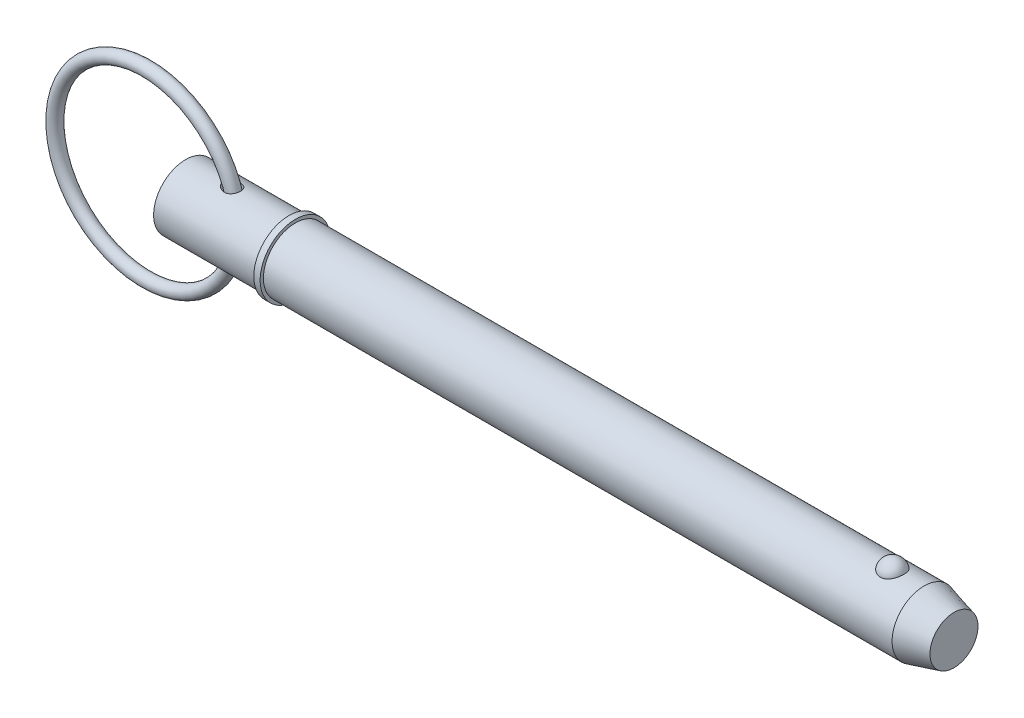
ISO-10303-21;
HEADER;
FILE_DESCRIPTION(('STEP AP214'),'2;1');
FILE_NAME('part.step','',(''),(''),'','','');
FILE_SCHEMA(('AUTOMOTIVE_DESIGN { 1 0 10303 214 1 1 1 1 }'));
ENDSEC;
DATA;
#1=APPLICATION_CONTEXT('core data for automotive mechanical design processes');
#2=APPLICATION_PROTOCOL_DEFINITION('international standard','automotive_design',2000,#1);
#3=PRODUCT_CONTEXT('',#1,'mechanical');
#4=PRODUCT('Part','Part','',(#3));
#5=PRODUCT_RELATED_PRODUCT_CATEGORY('part','',(#4));
#6=PRODUCT_DEFINITION_FORMATION('','',#4);
#7=PRODUCT_DEFINITION_CONTEXT('part definition',#1,'design');
#8=PRODUCT_DEFINITION('design','',#6,#7);
#9=PRODUCT_DEFINITION_SHAPE('','',#8);
#10=(LENGTH_UNIT() NAMED_UNIT(*) SI_UNIT(.MILLI.,.METRE.));
#11=(NAMED_UNIT(*) PLANE_ANGLE_UNIT() SI_UNIT($,.RADIAN.));
#12=(NAMED_UNIT(*) SI_UNIT($,.STERADIAN.) SOLID_ANGLE_UNIT());
#13=UNCERTAINTY_MEASURE_WITH_UNIT(LENGTH_MEASURE(1.E-05),#10,'distance_accuracy_value','');
#14=(GEOMETRIC_REPRESENTATION_CONTEXT(3) GLOBAL_UNCERTAINTY_ASSIGNED_CONTEXT((#13)) GLOBAL_UNIT_ASSIGNED_CONTEXT((#10,
#11,#12)) REPRESENTATION_CONTEXT('',''));
#15=CARTESIAN_POINT('',(0.,0.,0.));
#16=DIRECTION('',(0.,0.,1.));
#17=DIRECTION('',(1.,0.,0.));
#18=AXIS2_PLACEMENT_3D('',#15,#16,#17);
#19=CARTESIAN_POINT('',(-13.640845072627,0.,0.));
#20=DIRECTION('',(0.,0.,1.));
#21=DIRECTION('',(1.,0.,0.));
#22=AXIS2_PLACEMENT_3D('',#19,#20,#21);
#23=TOROIDAL_SURFACE('',#22,31.75,2.223);
#24=CARTESIAN_POINT('',(20.332154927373,0.,0.));
#25=VERTEX_POINT('',#24);
#26=VERTEX_LOOP('',#25);
#27=FACE_BOUND('',#26,.T.);
#28=ADVANCED_FACE('P0_F12',(#27),#23,.T.);
#29=CLOSED_SHELL('',(#28));
#30=MANIFOLD_SOLID_BREP('P0_B1',#29);
#31=CARTESIAN_POINT('',(0.,0.,0.));
#32=DIRECTION('',(1.,0.,0.));
#33=DIRECTION('',(0.,0.,-1.));
#34=AXIS2_PLACEMENT_3D('',#31,#32,#33);
#35=CYLINDRICAL_SURFACE('',#34,11.115);
#36=CARTESIAN_POINT('',(13.5245830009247,11.0328953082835,-1.34849772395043));
#37=CARTESIAN_POINT('',(13.6190616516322,11.0150940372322,-1.49413162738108));
#38=CARTESIAN_POINT('',(13.7272589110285,10.9954577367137,-1.63076546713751));
#39=CARTESIAN_POINT('',(13.9654537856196,10.9550099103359,-1.8834727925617));
#40=CARTESIAN_POINT('',(14.0954990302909,10.9341958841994,-1.99950019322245));
#41=CARTESIAN_POINT('',(14.3718600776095,10.893854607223,-2.20871939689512));
#42=CARTESIAN_POINT('',(14.5180879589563,10.8743212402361,-2.30202655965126));
#43=CARTESIAN_POINT('',(14.8233821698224,10.8385071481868,-2.46515115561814));
#44=CARTESIAN_POINT('',(14.9824448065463,10.8222254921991,-2.53497531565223));
#45=CARTESIAN_POINT('',(15.3233581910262,10.7936101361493,-2.65430007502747));
#46=CARTESIAN_POINT('',(15.5060064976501,10.7817126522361,-2.7016502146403));
#47=CARTESIAN_POINT('',(15.8771124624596,10.7657570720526,-2.76455948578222));
#48=CARTESIAN_POINT('',(16.0655695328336,10.7616981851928,-2.78012182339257));
#49=CARTESIAN_POINT('',(16.4345152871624,10.7624400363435,-2.77724928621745));
#50=CARTESIAN_POINT('',(16.6150121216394,10.7668823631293,-2.76018977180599));
#51=CARTESIAN_POINT('',(16.9695132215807,10.7837407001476,-2.69357457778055));
#52=CARTESIAN_POINT('',(17.1435222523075,10.7961507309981,-2.64404326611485));
#53=CARTESIAN_POINT('',(17.4621418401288,10.8258984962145,-2.51928348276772));
#54=CARTESIAN_POINT('',(17.6079677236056,10.8426430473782,-2.44700611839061));
#55=CARTESIAN_POINT('',(17.884162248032,10.8794194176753,-2.27791740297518));
#56=CARTESIAN_POINT('',(18.0145349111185,10.8994503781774,-2.18111245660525));
#57=CARTESIAN_POINT('',(18.2494965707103,10.9392822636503,-1.9713196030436));
#58=CARTESIAN_POINT('',(18.3550661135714,10.9590421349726,-1.85941863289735));
#59=CARTESIAN_POINT('',(18.5458147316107,10.9970986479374,-1.61919918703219));
#60=CARTESIAN_POINT('',(18.6309947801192,11.0153953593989,-1.49088149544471));
#61=CARTESIAN_POINT('',(18.7786686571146,11.0484675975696,-1.2218388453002));
#62=CARTESIAN_POINT('',(18.8412214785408,11.063252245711,-1.08114735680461));
#63=CARTESIAN_POINT('',(18.9425265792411,11.0877718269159,-0.791025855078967));
#64=CARTESIAN_POINT('',(18.9812780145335,11.0975065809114,-0.641595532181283));
#65=CARTESIAN_POINT('',(19.0343305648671,11.1109435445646,-0.336997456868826));
#66=CARTESIAN_POINT('',(19.0484404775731,11.1145985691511,-0.181794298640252));
#67=CARTESIAN_POINT('',(19.0513147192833,11.1153384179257,0.128864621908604));
#68=CARTESIAN_POINT('',(19.0400783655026,11.112423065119,0.284320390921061));
#69=CARTESIAN_POINT('',(18.9924362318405,11.1003163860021,0.591525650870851));
#70=CARTESIAN_POINT('',(18.9559600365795,11.0911075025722,0.743263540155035));
#71=CARTESIAN_POINT('',(18.858576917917,11.0673920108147,1.0382524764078));
#72=CARTESIAN_POINT('',(18.7976699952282,11.0528854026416,1.18150352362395));
#73=CARTESIAN_POINT('',(18.6529960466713,11.020201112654,1.45511394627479));
#74=CARTESIAN_POINT('',(18.5692772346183,11.0020311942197,1.58549973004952));
#75=CARTESIAN_POINT('',(18.3810003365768,10.9640237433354,1.82995492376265));
#76=CARTESIAN_POINT('',(18.2764441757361,10.9441863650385,1.94402583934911));
#77=CARTESIAN_POINT('',(18.0501398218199,10.9052267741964,2.15183128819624));
#78=CARTESIAN_POINT('',(17.9285270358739,10.8861003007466,2.24571250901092));
#79=CARTESIAN_POINT('',(17.6709592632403,10.8505244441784,2.41175942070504));
#80=CARTESIAN_POINT('',(17.5350055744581,10.8340748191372,2.48392707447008));
#81=CARTESIAN_POINT('',(17.2528390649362,10.8056099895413,2.60497667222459));
#82=CARTESIAN_POINT('',(17.1066353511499,10.7935909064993,2.65387899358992));
#83=CARTESIAN_POINT('',(16.8080326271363,10.7750969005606,2.72799859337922));
#84=CARTESIAN_POINT('',(16.6556326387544,10.7686228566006,2.75321211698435));
#85=CARTESIAN_POINT('',(16.3428877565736,10.761517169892,2.78086153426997));
#86=CARTESIAN_POINT('',(16.1824599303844,10.7611149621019,2.78240297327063));
#87=CARTESIAN_POINT('',(15.863296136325,10.766478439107,2.76156874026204));
#88=CARTESIAN_POINT('',(15.7045607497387,10.7722461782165,2.73918510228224));
#89=CARTESIAN_POINT('',(15.3787211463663,10.7898500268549,2.66904167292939));
#90=CARTESIAN_POINT('',(15.2120794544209,10.8021675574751,2.61925575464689));
#91=CARTESIAN_POINT('',(14.8886284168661,10.8315482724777,2.49496357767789));
#92=CARTESIAN_POINT('',(14.731827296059,10.8486153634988,2.42043695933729));
#93=CARTESIAN_POINT('',(14.4198762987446,10.8870804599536,2.24137362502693));
#94=CARTESIAN_POINT('',(14.2658484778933,10.9087148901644,2.13492229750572));
#95=CARTESIAN_POINT('',(13.9788214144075,10.9526299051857,1.89676517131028));
#96=CARTESIAN_POINT('',(13.8458041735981,10.9749099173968,1.76508120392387));
#97=CARTESIAN_POINT('',(13.6310853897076,11.012885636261,1.50762337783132));
#98=CARTESIAN_POINT('',(13.5444453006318,11.0290026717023,1.38602082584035));
#99=CARTESIAN_POINT('',(13.392158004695,11.0581740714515,1.12983363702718));
#100=CARTESIAN_POINT('',(13.3264946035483,11.0712307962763,0.995259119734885));
#101=CARTESIAN_POINT('',(13.2464179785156,11.0874250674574,0.785640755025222));
#102=CARTESIAN_POINT('',(13.2227369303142,11.0922707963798,0.714166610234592));
#103=CARTESIAN_POINT('',(13.1820656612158,11.1006486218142,0.569277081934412));
#104=CARTESIAN_POINT('',(13.1650721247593,11.1041813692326,0.495862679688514));
#105=CARTESIAN_POINT('',(13.1381118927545,11.1098070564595,0.347711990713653));
#106=CARTESIAN_POINT('',(13.1281436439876,11.1119003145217,0.272975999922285));
#107=CARTESIAN_POINT('',(13.1154243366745,11.1145746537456,0.122890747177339));
#108=CARTESIAN_POINT('',(13.1126723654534,11.1151559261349,0.0475415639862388));
#109=CARTESIAN_POINT('',(13.115160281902,11.1146296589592,-0.160384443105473));
#110=CARTESIAN_POINT('',(13.128061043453,11.111903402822,-0.292944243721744));
#111=CARTESIAN_POINT('',(13.175691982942,11.1019662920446,-0.553751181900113));
#112=CARTESIAN_POINT('',(13.2104121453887,11.094757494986,-0.682000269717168));
#113=CARTESIAN_POINT('',(13.2891255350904,11.0787645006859,-0.901873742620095));
#114=CARTESIAN_POINT('',(13.3290466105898,11.0707438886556,-0.995044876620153));
#115=CARTESIAN_POINT('',(13.4192915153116,11.0529876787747,-1.17599209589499));
#116=CARTESIAN_POINT('',(13.4696154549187,11.0432520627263,-1.26376812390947));
#117=CARTESIAN_POINT('',(13.5245830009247,11.0328953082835,-1.34849772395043));
#118=B_SPLINE_CURVE_WITH_KNOTS('',3,(#36,#37,#38,#39,#40,#41,#42,#43,#44,#45,#46,#47,#48,#49,
#50,#51,#52,#53,#54,#55,#56,#57,#58,#59,#60,#61,#62,#63,#64,#65,#66,#67,#68,#69,#70,#71,#72,#73,
#74,#75,#76,#77,#78,#79,#80,#81,#82,#83,#84,#85,#86,#87,#88,#89,#90,#91,#92,#93,#94,#95,#96,#97,
#98,#99,#100,#101,#102,#103,#104,#105,#106,#107,#108,#109,#110,#111,#112,#113,#114,#115,#116,
#117),.UNSPECIFIED.,.T.,.F.,(4,2,2,2,2,2,2,2,2,2,2,2,2,2,2,2,2,2,2,2,2,2,2,2,2,2,2,2,2,2,2,2,2,
2,2,2,2,2,2,2,4),(0.,0.52309976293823,1.04735506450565,1.56889024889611,2.09027590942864,
2.65465173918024,3.21897064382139,3.76002078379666,4.30066536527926,4.78898318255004,
5.27717362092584,5.74028268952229,6.20336964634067,6.665240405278,7.12712754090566,
7.59258295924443,8.05805091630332,8.52482272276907,8.99159451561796,9.45738731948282,
9.9231371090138,10.3853792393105,10.8475795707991,11.3093743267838,11.7712422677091,
12.2505208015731,12.7299589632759,13.2508366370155,13.7721440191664,14.334890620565,
14.8971525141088,15.3459336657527,15.7943675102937,16.0204422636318,16.2464047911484,
16.4723173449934,16.6982013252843,17.095711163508,17.4930386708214,17.7973741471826,
18.1017128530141),.UNSPECIFIED.);
#119=CARTESIAN_POINT('',(13.5245830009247,11.0328953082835,-1.34849772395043));
#120=VERTEX_POINT('',#119);
#121=EDGE_CURVE('P1_E42',#120,#120,#118,.T.);
#122=ORIENTED_EDGE('',*,*,#121,.T.);
#123=EDGE_LOOP('',(#122));
#124=FACE_BOUND('',#123,.T.);
#125=CARTESIAN_POINT('',(0.,0.,0.));
#126=DIRECTION('',(1.,0.,0.));
#127=DIRECTION('',(0.,0.,-1.));
#128=AXIS2_PLACEMENT_3D('',#125,#126,#127);
#129=CIRCLE('',#128,11.115);
#130=CARTESIAN_POINT('',(0.,0.,-11.115));
#131=VERTEX_POINT('',#130);
#132=EDGE_CURVE('P1_E9',#131,#131,#129,.T.);
#133=ORIENTED_EDGE('',*,*,#132,.T.);
#134=EDGE_LOOP('',(#133));
#135=FACE_BOUND('',#134,.T.);
#136=CARTESIAN_POINT('',(35.877,0.,0.));
#137=DIRECTION('',(1.,0.,0.));
#138=DIRECTION('',(0.,0.,-1.));
#139=AXIS2_PLACEMENT_3D('',#136,#137,#138);
#140=CIRCLE('',#139,11.115);
#141=CARTESIAN_POINT('',(35.877,0.,-11.115));
#142=VERTEX_POINT('',#141);
#143=EDGE_CURVE('P1_E25',#142,#142,#140,.T.);
#144=ORIENTED_EDGE('',*,*,#143,.F.);
#145=EDGE_LOOP('',(#144));
#146=FACE_BOUND('',#145,.T.);
#147=CARTESIAN_POINT('',(13.5245830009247,-11.0328953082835,-1.34849772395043));
#148=CARTESIAN_POINT('',(13.449887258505,-11.0469690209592,-1.233356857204));
#149=CARTESIAN_POINT('',(13.3837464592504,-11.0598986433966,-1.11255897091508));
#150=CARTESIAN_POINT('',(13.271526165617,-11.0822620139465,-0.861680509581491));
#151=CARTESIAN_POINT('',(13.2254273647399,-11.0916991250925,-0.731609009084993));
#152=CARTESIAN_POINT('',(13.1557497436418,-11.1060943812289,-0.464578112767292));
#153=CARTESIAN_POINT('',(13.1322820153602,-11.111030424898,-0.327588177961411));
#154=CARTESIAN_POINT('',(13.1098958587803,-11.1157368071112,-0.0515139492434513));
#155=CARTESIAN_POINT('',(13.1109730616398,-11.1155080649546,0.0875699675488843));
#156=CARTESIAN_POINT('',(13.1367722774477,-11.110088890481,0.354927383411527));
#157=CARTESIAN_POINT('',(13.160070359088,-11.1051972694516,0.483348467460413));
#158=CARTESIAN_POINT('',(13.2268311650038,-11.091413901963,0.734581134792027));
#159=CARTESIAN_POINT('',(13.2702981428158,-11.0825213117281,0.857391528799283));
#160=CARTESIAN_POINT('',(13.3769008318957,-11.0612491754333,1.09871322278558));
#161=CARTESIAN_POINT('',(13.4406446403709,-11.048763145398,1.21694419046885));
#162=CARTESIAN_POINT('',(13.5844860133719,-11.0215642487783,1.44267020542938));
#163=CARTESIAN_POINT('',(13.6645903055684,-11.0068504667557,1.55016080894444));
#164=CARTESIAN_POINT('',(13.8511803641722,-10.9741237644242,1.76795565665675));
#165=CARTESIAN_POINT('',(13.959808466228,-10.9559422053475,1.87639683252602));
#166=CARTESIAN_POINT('',(14.1916437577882,-10.9197998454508,2.07642617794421));
#167=CARTESIAN_POINT('',(14.3148607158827,-10.901839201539,2.16800294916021));
#168=CARTESIAN_POINT('',(14.5931107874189,-10.8649902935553,2.34622033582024));
#169=CARTESIAN_POINT('',(14.7501095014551,-10.8463937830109,2.42986679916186));
#170=CARTESIAN_POINT('',(15.0757118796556,-10.8136392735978,2.57171975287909));
#171=CARTESIAN_POINT('',(15.2443214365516,-10.7994835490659,2.62991321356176));
#172=CARTESIAN_POINT('',(15.599068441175,-10.7767894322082,2.72147498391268));
#173=CARTESIAN_POINT('',(15.7856559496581,-10.768622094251,2.75321798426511));
#174=CARTESIAN_POINT('',(16.1617095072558,-10.7608206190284,2.78356776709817));
#175=CARTESIAN_POINT('',(16.3511739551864,-10.7611818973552,2.78219235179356));
#176=CARTESIAN_POINT('',(16.7138126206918,-10.7705428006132,2.7457129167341));
#177=CARTESIAN_POINT('',(16.8872269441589,-10.7789612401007,2.71287798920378));
#178=CARTESIAN_POINT('',(17.2247245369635,-10.8028011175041,2.61632772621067));
#179=CARTESIAN_POINT('',(17.3888134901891,-10.8182182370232,2.55263143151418));
#180=CARTESIAN_POINT('',(17.6871641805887,-10.8524191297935,2.40281428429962));
#181=CARTESIAN_POINT('',(17.8227812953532,-10.8707652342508,2.31928155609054));
#182=CARTESIAN_POINT('',(18.0770765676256,-10.9094513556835,2.12988301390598));
#183=CARTESIAN_POINT('',(18.1957578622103,-10.9297910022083,2.0240213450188));
#184=CARTESIAN_POINT('',(18.4088055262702,-10.9693230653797,1.79719870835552));
#185=CARTESIAN_POINT('',(18.5038890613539,-10.9885305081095,1.67691225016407));
#186=CARTESIAN_POINT('',(18.6726701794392,-11.0244347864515,1.42183894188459));
#187=CARTESIAN_POINT('',(18.7463681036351,-11.0411316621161,1.28705232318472));
#188=CARTESIAN_POINT('',(18.8708297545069,-11.0702507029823,1.00634471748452));
#189=CARTESIAN_POINT('',(18.9215212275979,-11.0826593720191,0.860390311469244));
#190=CARTESIAN_POINT('',(18.9984973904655,-11.1017993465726,0.561823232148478));
#191=CARTESIAN_POINT('',(19.0247811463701,-11.1085304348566,0.409210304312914));
#192=CARTESIAN_POINT('',(19.0524622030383,-11.1156244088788,0.100537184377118));
#193=CARTESIAN_POINT('',(19.0536873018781,-11.1159432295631,-0.0555394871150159));
#194=CARTESIAN_POINT('',(19.0307837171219,-11.110065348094,-0.365700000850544));
#195=CARTESIAN_POINT('',(19.0066544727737,-11.1038685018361,-0.519783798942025));
#196=CARTESIAN_POINT('',(18.9335163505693,-11.0856111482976,-0.821817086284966));
#197=CARTESIAN_POINT('',(18.88447016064,-11.0735418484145,-0.969757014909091));
#198=CARTESIAN_POINT('',(18.7625929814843,-11.0448501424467,-1.25502066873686));
#199=CARTESIAN_POINT('',(18.6897623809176,-11.0282278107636,-1.39234456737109));
#200=CARTESIAN_POINT('',(18.522359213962,-10.9923333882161,-1.65195905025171));
#201=CARTESIAN_POINT('',(18.427863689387,-10.9730707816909,-1.77430060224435));
#202=CARTESIAN_POINT('',(18.2194216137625,-10.9340072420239,-2.00099176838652));
#203=CARTESIAN_POINT('',(18.1054772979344,-10.9142063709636,-2.10534344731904));
#204=CARTESIAN_POINT('',(17.8622613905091,-10.8764452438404,-2.2924289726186));
#205=CARTESIAN_POINT('',(17.7331196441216,-10.8584715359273,-2.3753290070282));
#206=CARTESIAN_POINT('',(17.4625069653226,-10.8261386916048,-2.51860389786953));
#207=CARTESIAN_POINT('',(17.3210365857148,-10.8117793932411,-2.57897976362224));
#208=CARTESIAN_POINT('',(17.0290309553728,-10.7880576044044,-2.67648805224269));
#209=CARTESIAN_POINT('',(16.8784484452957,-10.7787241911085,-2.71348542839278));
#210=CARTESIAN_POINT('',(16.573148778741,-10.7659618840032,-2.7636855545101));
#211=CARTESIAN_POINT('',(16.4184306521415,-10.7625343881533,-2.77688267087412));
#212=CARTESIAN_POINT('',(16.1008073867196,-10.761643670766,-2.78033419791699));
#213=CARTESIAN_POINT('',(15.9378898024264,-10.7644957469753,-2.76937572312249));
#214=CARTESIAN_POINT('',(15.6157286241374,-10.7762062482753,-2.72344300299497));
#215=CARTESIAN_POINT('',(15.4564861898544,-10.7850665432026,-2.68846128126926));
#216=CARTESIAN_POINT('',(15.1305734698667,-10.808737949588,-2.59174021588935));
#217=CARTESIAN_POINT('',(14.9645834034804,-10.8240246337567,-2.52782071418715));
#218=CARTESIAN_POINT('',(14.6448218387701,-10.8585969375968,-2.37491543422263));
#219=CARTESIAN_POINT('',(14.4910653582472,-10.8778873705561,-2.28589943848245));
#220=CARTESIAN_POINT('',(14.1837929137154,-10.920550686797,-2.07312951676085));
#221=CARTESIAN_POINT('',(14.0321999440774,-10.9441390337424,-1.94661563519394));
#222=CARTESIAN_POINT('',(13.756115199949,-10.9902311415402,-1.66673537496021));
#223=CARTESIAN_POINT('',(13.6315733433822,-11.0127368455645,-1.51341958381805));
#224=CARTESIAN_POINT('',(13.5245830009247,-11.0328953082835,-1.34849772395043));
#225=B_SPLINE_CURVE_WITH_KNOTS('',3,(#147,#148,#149,#150,#151,#152,#153,#154,#155,#156,#157,
#158,#159,#160,#161,#162,#163,#164,#165,#166,#167,#168,#169,#170,#171,#172,#173,#174,#175,#176,
#177,#178,#179,#180,#181,#182,#183,#184,#185,#186,#187,#188,#189,#190,#191,#192,#193,#194,#195,
#196,#197,#198,#199,#200,#201,#202,#203,#204,#205,#206,#207,#208,#209,#210,#211,#212,#213,#214,
#215,#216,#217,#218,#219,#220,#221,#222,#223,#224),.UNSPECIFIED.,.T.,.F.,(4,2,2,2,2,2,2,2,2,2,2,
2,2,2,2,2,2,2,2,2,2,2,2,2,2,2,2,2,2,2,2,2,2,2,2,2,2,2,4),(0.,0.4133945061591,0.8263899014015,
1.24140245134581,1.65634113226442,2.04635967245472,2.43646050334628,2.83958259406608,
3.24287078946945,3.70479277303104,4.16702582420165,4.70130512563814,5.23585761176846,
5.80123945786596,6.36631739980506,6.89348344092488,7.42032464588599,7.8989135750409,
8.37741373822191,8.83881993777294,9.30021877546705,9.76305681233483,10.2259125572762,
10.6919479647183,11.1579936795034,11.6247393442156,12.0914773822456,12.55658073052,
13.0216306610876,13.4829619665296,13.9442725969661,14.408224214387,14.8722856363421,
15.3601762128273,15.8482186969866,16.3815107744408,16.9154477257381,17.5086806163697,
18.1008056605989),.UNSPECIFIED.);
#226=CARTESIAN_POINT('',(13.5245830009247,-11.0328953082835,-1.34849772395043));
#227=VERTEX_POINT('',#226);
#228=EDGE_CURVE('P1_E17',#227,#227,#225,.T.);
#229=ORIENTED_EDGE('',*,*,#228,.T.);
#230=EDGE_LOOP('',(#229));
#231=FACE_BOUND('',#230,.T.);
#232=ADVANCED_FACE('P1_F13',(#124,#135,#146,#231),#35,.T.);
#233=CARTESIAN_POINT('',(0.,0.,0.));
#234=DIRECTION('',(1.,0.,0.));
#235=DIRECTION('',(0.,0.,-1.));
#236=AXIS2_PLACEMENT_3D('',#233,#234,#235);
#237=CYLINDRICAL_SURFACE('',#236,11.115);
#238=CARTESIAN_POINT('',(256.329563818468,0.,0.));
#239=DIRECTION('',(1.,0.,0.));
#240=DIRECTION('',(0.,0.,-1.));
#241=AXIS2_PLACEMENT_3D('',#238,#239,#240);
#242=CIRCLE('',#241,11.115);
#243=CARTESIAN_POINT('',(256.329563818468,0.,-11.115));
#244=VERTEX_POINT('',#243);
#245=EDGE_CURVE('P1_E99',#244,#244,#242,.T.);
#246=ORIENTED_EDGE('',*,*,#245,.F.);
#247=EDGE_LOOP('',(#246));
#248=FACE_BOUND('',#247,.T.);
#249=CARTESIAN_POINT('',(38.1,0.,0.));
#250=DIRECTION('',(1.,0.,0.));
#251=DIRECTION('',(0.,0.,-1.));
#252=AXIS2_PLACEMENT_3D('',#249,#250,#251);
#253=CIRCLE('',#252,11.115);
#254=CARTESIAN_POINT('',(38.1,0.,-11.115));
#255=VERTEX_POINT('',#254);
#256=EDGE_CURVE('P1_E96',#255,#255,#253,.T.);
#257=ORIENTED_EDGE('',*,*,#256,.T.);
#258=EDGE_LOOP('',(#257));
#259=FACE_BOUND('',#258,.T.);
#260=CARTESIAN_POINT('',(245.331068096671,10.3028087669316,4.17077409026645));
#261=CARTESIAN_POINT('',(245.114775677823,10.3028003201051,4.17078240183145));
#262=CARTESIAN_POINT('',(244.898548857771,10.3098895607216,4.15340593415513));
#263=CARTESIAN_POINT('',(244.472540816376,10.3373834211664,4.08449540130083));
#264=CARTESIAN_POINT('',(244.262757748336,10.3577841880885,4.0329712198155));
#265=CARTESIAN_POINT('',(243.855782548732,10.4095237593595,3.89746513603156));
#266=CARTESIAN_POINT('',(243.658572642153,10.4408466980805,3.81353029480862));
#267=CARTESIAN_POINT('',(243.281338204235,10.5110236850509,3.61560339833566));
#268=CARTESIAN_POINT('',(243.101317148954,10.5498792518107,3.50160528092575));
#269=CARTESIAN_POINT('',(242.757684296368,10.6322884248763,3.24292464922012));
#270=CARTESIAN_POINT('',(242.594686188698,10.6759443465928,3.0974604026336));
#271=CARTESIAN_POINT('',(242.294591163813,10.7625291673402,2.78171925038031));
#272=CARTESIAN_POINT('',(242.157499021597,10.8054579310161,2.61143778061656));
#273=CARTESIAN_POINT('',(241.906408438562,10.8881935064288,2.24226695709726));
#274=CARTESIAN_POINT('',(241.793710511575,10.9277761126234,2.04244123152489));
#275=CARTESIAN_POINT('',(241.601777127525,10.997484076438,1.62578254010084));
#276=CARTESIAN_POINT('',(241.522544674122,11.0276085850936,1.40894804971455));
#277=CARTESIAN_POINT('',(241.398303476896,11.0756732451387,0.961250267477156));
#278=CARTESIAN_POINT('',(241.353760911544,11.0934470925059,0.730239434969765));
#279=CARTESIAN_POINT('',(241.301569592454,11.1143331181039,0.263439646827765));
#280=CARTESIAN_POINT('',(241.293920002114,11.1174456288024,0.0276507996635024));
#281=CARTESIAN_POINT('',(241.31561056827,11.1087161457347,-0.440729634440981));
#282=CARTESIAN_POINT('',(241.344762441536,11.0969502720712,-0.673331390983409));
#283=CARTESIAN_POINT('',(241.439143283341,11.0597872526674,-1.12996621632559));
#284=CARTESIAN_POINT('',(241.504372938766,11.0343898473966,-1.35399912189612));
#285=CARTESIAN_POINT('',(241.66969844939,10.972515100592,-1.78750286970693));
#286=CARTESIAN_POINT('',(241.76983863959,10.9360236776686,-1.9969547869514));
#287=CARTESIAN_POINT('',(242.002940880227,10.8557595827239,-2.3952066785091));
#288=CARTESIAN_POINT('',(242.135905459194,10.8119863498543,-2.5840050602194));
#289=CARTESIAN_POINT('',(242.432407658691,10.7216733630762,-2.93635726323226));
#290=CARTESIAN_POINT('',(242.596056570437,10.675123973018,-3.09981510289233));
#291=CARTESIAN_POINT('',(242.949860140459,10.5846571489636,-3.39592247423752));
#292=CARTESIAN_POINT('',(243.140012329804,10.5407394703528,-3.52857487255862));
#293=CARTESIAN_POINT('',(243.53750141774,10.4616690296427,-3.75646057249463));
#294=CARTESIAN_POINT('',(243.74436705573,10.4263443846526,-3.85245432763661));
#295=CARTESIAN_POINT('',(244.172954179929,10.3675574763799,-4.00798747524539));
#296=CARTESIAN_POINT('',(244.394670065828,10.344090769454,-4.06754052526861));
#297=CARTESIAN_POINT('',(244.834669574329,10.3128282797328,-4.14614314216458));
#298=CARTESIAN_POINT('',(245.052565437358,10.3043040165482,-4.1670783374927));
#299=CARTESIAN_POINT('',(245.48894951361,10.3016771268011,-4.17357158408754));
#300=CARTESIAN_POINT('',(245.707437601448,10.3075716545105,-4.15913661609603));
#301=CARTESIAN_POINT('',(246.131744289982,10.3326686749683,-4.09636961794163));
#302=CARTESIAN_POINT('',(246.337745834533,10.3514555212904,-4.0490957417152));
#303=CARTESIAN_POINT('',(246.738576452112,10.399818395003,-3.92320197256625));
#304=CARTESIAN_POINT('',(246.9334046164,10.4293952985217,-3.84457953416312));
#305=CARTESIAN_POINT('',(247.311191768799,10.4969600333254,-3.65612410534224));
#306=CARTESIAN_POINT('',(247.493797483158,10.5351178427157,-3.54564545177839));
#307=CARTESIAN_POINT('',(247.838204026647,10.6154999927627,-3.29718036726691));
#308=CARTESIAN_POINT('',(248.000000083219,10.657725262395,-3.15918764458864));
#309=CARTESIAN_POINT('',(248.306959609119,10.744212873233,-2.85163580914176));
#310=CARTESIAN_POINT('',(248.450891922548,10.7884718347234,-2.68084605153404));
#311=CARTESIAN_POINT('',(248.709237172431,10.872374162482,-2.31721864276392));
#312=CARTESIAN_POINT('',(248.823644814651,10.9120167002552,-2.12437704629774));
#313=CARTESIAN_POINT('',(249.023873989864,10.9838919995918,-1.71516999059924));
#314=CARTESIAN_POINT('',(249.10866178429,11.0158465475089,-1.49824866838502));
#315=CARTESIAN_POINT('',(249.24268382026,11.0673523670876,-1.05228572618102));
#316=CARTESIAN_POINT('',(249.291917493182,11.086903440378,-0.823243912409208));
#317=CARTESIAN_POINT('',(249.353891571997,11.1116323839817,-0.3590874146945));
#318=CARTESIAN_POINT('',(249.366566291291,11.1167843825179,-0.123962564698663));
#319=CARTESIAN_POINT('',(249.354973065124,11.1121144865,0.345220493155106));
#320=CARTESIAN_POINT('',(249.330705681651,11.1022928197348,0.579278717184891));
#321=CARTESIAN_POINT('',(249.245907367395,11.0687504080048,1.03866534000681));
#322=CARTESIAN_POINT('',(249.185529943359,11.0450885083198,1.26402641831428));
#323=CARTESIAN_POINT('',(249.029853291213,10.9863185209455,1.70076772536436));
#324=CARTESIAN_POINT('',(248.934551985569,10.9512097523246,1.91214712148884));
#325=CARTESIAN_POINT('',(248.710397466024,10.8729733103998,2.316083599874));
#326=CARTESIAN_POINT('',(248.581380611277,10.8298068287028,2.50854240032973));
#327=CARTESIAN_POINT('',(248.292732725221,10.7401896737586,2.86808766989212));
#328=CARTESIAN_POINT('',(248.133102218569,10.6937390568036,3.03517457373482));
#329=CARTESIAN_POINT('',(247.787534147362,10.6029321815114,3.33857581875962));
#330=CARTESIAN_POINT('',(247.601708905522,10.5585680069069,3.47501541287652));
#331=CARTESIAN_POINT('',(247.207875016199,10.4769321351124,3.71390897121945));
#332=CARTESIAN_POINT('',(246.999863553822,10.439661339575,3.81635861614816));
#333=CARTESIAN_POINT('',(246.554066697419,10.3749407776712,3.98910631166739));
#334=CARTESIAN_POINT('',(246.315234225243,10.3482457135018,4.05700929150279));
#335=CARTESIAN_POINT('',(245.827925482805,10.312188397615,4.14782844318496));
#336=CARTESIAN_POINT('',(245.579453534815,10.3028184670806,4.17076454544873));
#337=CARTESIAN_POINT('',(245.331068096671,10.3028087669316,4.17077409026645));
#338=B_SPLINE_CURVE_WITH_KNOTS('',3,(#260,#261,#262,#263,#264,#265,#266,#267,#268,#269,#270,
#271,#272,#273,#274,#275,#276,#277,#278,#279,#280,#281,#282,#283,#284,#285,#286,#287,#288,#289,
#290,#291,#292,#293,#294,#295,#296,#297,#298,#299,#300,#301,#302,#303,#304,#305,#306,#307,#308,
#309,#310,#311,#312,#313,#314,#315,#316,#317,#318,#319,#320,#321,#322,#323,#324,#325,#326,#327,
#328,#329,#330,#331,#332,#333,#334,#335,#336,#337),.UNSPECIFIED.,.T.,.F.,(4,2,2,2,2,2,2,2,2,2,2,
2,2,2,2,2,2,2,2,2,2,2,2,2,2,2,2,2,2,2,2,2,2,2,2,2,2,2,4),(0.,0.64796614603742,1.29574482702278,
1.9425864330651,2.58955857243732,3.25496465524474,3.92049326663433,4.61566368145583,
5.31089647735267,6.01531821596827,6.71972398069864,7.42054043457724,8.12137023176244,
8.82309331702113,9.52487047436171,10.2292439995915,10.9335519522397,11.6223330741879,
12.3108558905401,12.9647664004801,13.6185478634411,14.252184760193,14.8858731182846,
15.5334360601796,16.1811472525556,16.8611459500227,17.5412664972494,18.2431855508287,
18.9451158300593,19.6483065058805,20.3514864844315,21.0516982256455,21.7519516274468,
22.4556690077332,23.1593743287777,23.8601491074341,24.5610129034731,25.3054529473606,
26.049562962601),.UNSPECIFIED.);
#339=CARTESIAN_POINT('',(245.331068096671,10.3028087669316,4.17077409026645));
#340=VERTEX_POINT('',#339);
#341=EDGE_CURVE('P1_E34',#340,#340,#338,.T.);
#342=ORIENTED_EDGE('',*,*,#341,.T.);
#343=EDGE_LOOP('',(#342));
#344=FACE_BOUND('',#343,.T.);
#345=ADVANCED_FACE('P1_F46',(#248,#259,#344),#237,.T.);
#346=CARTESIAN_POINT('',(0.,0.,0.));
#347=DIRECTION('',(-1.,0.,0.));
#348=DIRECTION('',(0.,0.,1.));
#349=AXIS2_PLACEMENT_3D('',#346,#347,#348);
#350=PLANE('',#349);
#351=ORIENTED_EDGE('',*,*,#132,.F.);
#352=EDGE_LOOP('',(#351));
#353=FACE_BOUND('',#352,.T.);
#354=ADVANCED_FACE('P1_F15',(#353),#350,.T.);
#355=CARTESIAN_POINT('',(35.877,11.115,0.));
#356=DIRECTION('',(-1.,0.,0.));
#357=DIRECTION('',(0.,0.,1.));
#358=AXIS2_PLACEMENT_3D('',#355,#356,#357);
#359=PLANE('',#358);
#360=ORIENTED_EDGE('',*,*,#143,.T.);
#361=EDGE_LOOP('',(#360));
#362=FACE_BOUND('',#361,.T.);
#363=CARTESIAN_POINT('',(35.877,0.,0.));
#364=DIRECTION('',(1.,0.,0.));
#365=DIRECTION('',(0.,0.,-1.));
#366=AXIS2_PLACEMENT_3D('',#363,#364,#365);
#367=CIRCLE('',#366,12.2265);
#368=CARTESIAN_POINT('',(35.877,0.,-12.2265));
#369=VERTEX_POINT('',#368);
#370=EDGE_CURVE('P1_E30',#369,#369,#367,.T.);
#371=ORIENTED_EDGE('',*,*,#370,.F.);
#372=EDGE_LOOP('',(#371));
#373=FACE_BOUND('',#372,.T.);
#374=ADVANCED_FACE('P1_F81',(#362,#373),#359,.T.);
#375=CARTESIAN_POINT('',(0.,0.,0.));
#376=DIRECTION('',(1.,0.,0.));
#377=DIRECTION('',(0.,0.,-1.));
#378=AXIS2_PLACEMENT_3D('',#375,#376,#377);
#379=CYLINDRICAL_SURFACE('',#378,12.2265);
#380=ORIENTED_EDGE('',*,*,#370,.T.);
#381=EDGE_LOOP('',(#380));
#382=FACE_BOUND('',#381,.T.);
#383=CARTESIAN_POINT('',(38.1,0.,0.));
#384=DIRECTION('',(1.,0.,0.));
#385=DIRECTION('',(0.,0.,-1.));
#386=AXIS2_PLACEMENT_3D('',#383,#384,#385);
#387=CIRCLE('',#386,12.2265);
#388=CARTESIAN_POINT('',(38.1,0.,-12.2265));
#389=VERTEX_POINT('',#388);
#390=EDGE_CURVE('P1_E95',#389,#389,#387,.T.);
#391=ORIENTED_EDGE('',*,*,#390,.F.);
#392=EDGE_LOOP('',(#391));
#393=FACE_BOUND('',#392,.T.);
#394=ADVANCED_FACE('P1_F68',(#382,#393),#379,.T.);
#395=CARTESIAN_POINT('',(38.1,12.2265,0.));
#396=DIRECTION('',(1.,0.,0.));
#397=DIRECTION('',(0.,0.,-1.));
#398=AXIS2_PLACEMENT_3D('',#395,#396,#397);
#399=PLANE('',#398);
#400=ORIENTED_EDGE('',*,*,#390,.T.);
#401=EDGE_LOOP('',(#400));
#402=FACE_BOUND('',#401,.T.);
#403=ORIENTED_EDGE('',*,*,#256,.F.);
#404=EDGE_LOOP('',(#403));
#405=FACE_BOUND('',#404,.T.);
#406=ADVANCED_FACE('P1_F62',(#402,#405),#399,.T.);
#407=CARTESIAN_POINT('',(266.7,0.,0.));
#408=DIRECTION('',(-1.,0.,0.));
#409=DIRECTION('',(0.,0.,1.));
#410=AXIS2_PLACEMENT_3D('',#407,#408,#409);
#411=CONICAL_SURFACE('',#410,8.33625000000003,0.26179938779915);
#412=ORIENTED_EDGE('',*,*,#245,.T.);
#413=EDGE_LOOP('',(#412));
#414=FACE_BOUND('',#413,.T.);
#415=CARTESIAN_POINT('',(266.7,0.,0.));
#416=DIRECTION('',(1.,0.,0.));
#417=DIRECTION('',(0.,0.,-1.));
#418=AXIS2_PLACEMENT_3D('',#415,#416,#417);
#419=CIRCLE('',#418,8.33625000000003);
#420=CARTESIAN_POINT('',(266.7,0.,-8.33625000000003));
#421=VERTEX_POINT('',#420);
#422=EDGE_CURVE('P1_E41',#421,#421,#419,.T.);
#423=ORIENTED_EDGE('',*,*,#422,.F.);
#424=EDGE_LOOP('',(#423));
#425=FACE_BOUND('',#424,.T.);
#426=ADVANCED_FACE('P1_F59',(#414,#425),#411,.T.);
#427=CARTESIAN_POINT('',(266.7,8.33625000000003,0.));
#428=DIRECTION('',(1.,0.,0.));
#429=DIRECTION('',(0.,0.,-1.));
#430=AXIS2_PLACEMENT_3D('',#427,#428,#429);
#431=PLANE('',#430);
#432=ORIENTED_EDGE('',*,*,#422,.T.);
#433=EDGE_LOOP('',(#432));
#434=FACE_BOUND('',#433,.T.);
#435=ADVANCED_FACE('P1_F55',(#434),#431,.T.);
#436=CARTESIAN_POINT('',(245.331068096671,10.0035,0.));
#437=DIRECTION('',(-1.,0.,0.));
#438=DIRECTION('',(0.,1.,0.));
#439=AXIS2_PLACEMENT_3D('',#436,#437,#438);
#440=SPHERICAL_SURFACE('',#439,4.18150000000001);
#441=ORIENTED_EDGE('',*,*,#341,.F.);
#442=EDGE_LOOP('',(#441));
#443=FACE_BOUND('',#442,.T.);
#444=ADVANCED_FACE('P1_F50',(#443),#440,.T.);
#445=CARTESIAN_POINT('',(-13.640845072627,0.,0.));
#446=DIRECTION('',(0.,0.,1.));
#447=DIRECTION('',(1.,0.,0.));
#448=AXIS2_PLACEMENT_3D('',#445,#446,#447);
#449=TOROIDAL_SURFACE('',#448,31.75,2.77875);
#450=ORIENTED_EDGE('',*,*,#228,.F.);
#451=EDGE_LOOP('',(#450));
#452=FACE_BOUND('',#451,.T.);
#453=ORIENTED_EDGE('',*,*,#121,.F.);
#454=EDGE_LOOP('',(#453));
#455=FACE_BOUND('',#454,.T.);
#456=ADVANCED_FACE('P1_F54',(#452,#455),#449,.F.);
#457=CLOSED_SHELL('',(#232,#345,#354,#374,#394,#406,#426,#435,#444,#456));
#458=MANIFOLD_SOLID_BREP('P1_B1',#457);
#459=ADVANCED_BREP_SHAPE_REPRESENTATION('',(#18,#30,#458),#14);
#460=SHAPE_DEFINITION_REPRESENTATION(#9,#459);
ENDSEC;
END-ISO-10303-21;
